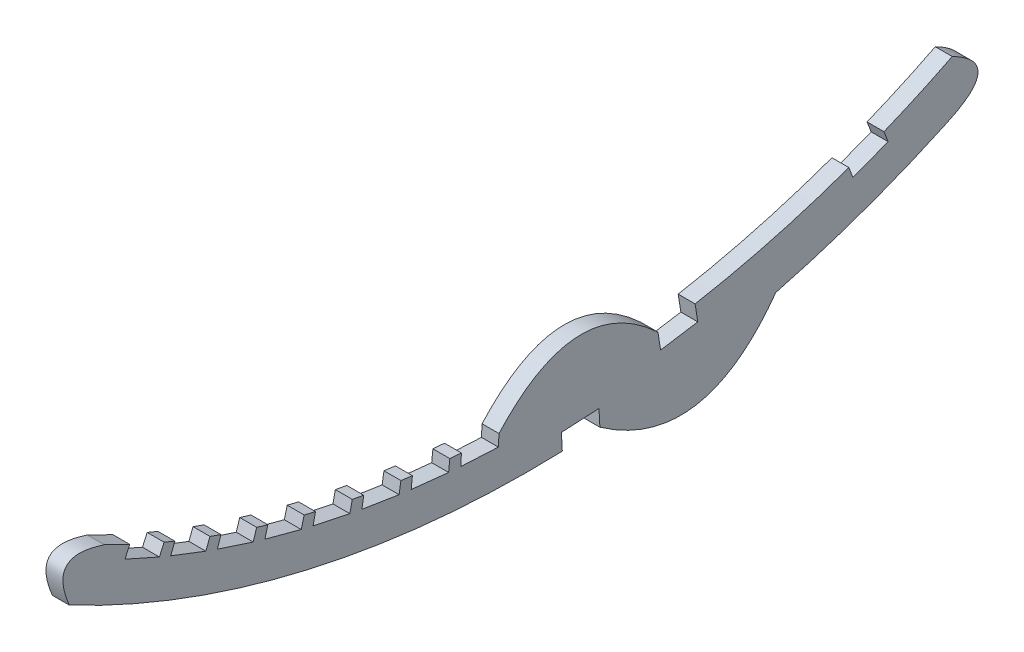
from build123d import *

# Parameters (mm, degrees)
BOSS_EXTRUDE1_DEPTH = 18


with BuildPart() as part:
    # Sketch1 → Boss-Extrude1 (new body)
    with BuildSketch(Plane(origin=(0, 0, 0), x_dir=(0, 0, -1), z_dir=(1, 0, 0))):
        with BuildLine():
            Line((139.496518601, -1008.595420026), (159.250285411, -1005.466730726))
            Line((159.250285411, -1005.466730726), (179.004052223, -1002.338041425))
            Line((179.004052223, -1002.338041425), (178.065445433, -996.411911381))
            Line((178.065445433, -996.411911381), (176.15694183, -984.362093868))
            ThreePointArc((176.15694183, -984.362093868), (258.819045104, -965.925826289), (339.624660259, -940.561050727))
            Line((339.624660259, -940.561050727), (343.996756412, -951.950750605))
            Line((343.996756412, -951.950750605), (362.66836494, -944.783391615))
            Line((362.66836494, -944.783391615), (381.33997347, -937.616032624))
            Line((381.33997347, -937.616032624), (376.967877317, -926.226332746))
            ThreePointArc((376.967877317, -926.226332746), (413.561748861, -910.476073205), (449.499222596, -893.28072233))
            add(Edge.make_bspline(
                [(440.353085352, -953.199433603), (508.567576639, -923.50836104), (449.499222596, -893.28072233)],
                knots=[0, 0, 0, 1, 1, 1], degree=2))
            ThreePointArc((440.353085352, -953.199433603), (352.562945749, -989.039619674), (261.897418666, -1016.813523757))
            add(Edge.make_bspline(
                [(74.915375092, -1047.324059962), (184.668223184, -1124.14994039), (261.897418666, -1016.813523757)],
                knots=[0, 0, 0, 1, 1, 1], degree=2))
            Line((74.915375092, -1047.324059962), (73.983297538, -1029.538960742))
            Line((73.983297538, -1029.538960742), (54.010706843, -1030.585679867))
            Line((54.010706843, -1030.585679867), (34.03811615, -1031.632398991))
            Line((34.03811615, -1031.632398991), (34.970193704, -1049.417498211))
            ThreePointArc((34.970193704, -1049.417498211), (-234.905822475, -1023.386170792), (-489.119171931, -929.119171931))
            add(Edge.make_bspline(
                [(-489.119171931, -929.119171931), (-513.223066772, -871.781237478), (-452.011904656, -892.011904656)],
                knots=[0, 0, 0, 1, 1, 1], degree=2))
            ThreePointArc((-452.011904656, -892.011904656), (-438.518841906, -898.721995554), (-424.926196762, -905.227997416))
            Line((-424.926196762, -905.227997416), (-429.888391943, -916.373270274))
            Line((-429.888391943, -916.373270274), (-411.617482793, -924.508003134))
            Line((-411.617482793, -924.508003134), (-393.34657364, -932.642735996))
            Line((-393.34657364, -932.642735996), (-388.384378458, -921.497463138))
            ThreePointArc((-388.384378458, -921.497463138), (-382.683432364, -923.879532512), (-376.967877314, -926.226332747))
            Line((-376.967877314, -926.226332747), (-381.339973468, -937.616032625))
            Line((-381.339973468, -937.616032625), (-362.66836494, -944.783391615))
            Line((-362.66836494, -944.783391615), (-343.99675641, -951.950750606))
            Line((-343.99675641, -951.950750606), (-339.624660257, -940.561050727))
            ThreePointArc((-339.624660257, -940.561050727), (-333.806859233, -942.641491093), (-327.976315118, -944.68594608))
            Line((-327.976315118, -944.68594608), (-331.746328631, -956.288854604))
            Line((-331.746328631, -956.288854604), (-312.725198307, -962.469194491))
            Line((-312.725198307, -962.469194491), (-293.704067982, -968.649534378))
            Line((-293.704067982, -968.649534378), (-289.934054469, -957.046625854))
            ThreePointArc((-289.934054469, -957.046625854), (-284.015344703, -958.819734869), (-278.08579264, -960.5562409))
            Line((-278.08579264, -960.5562409), (-281.243390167, -972.340555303))
            Line((-281.243390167, -972.340555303), (-261.924873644, -977.516936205))
            Line((-261.924873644, -977.516936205), (-242.606357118, -982.693317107))
            Line((-242.606357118, -982.693317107), (-239.44875959, -970.909002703))
            ThreePointArc((-239.44875959, -970.909002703), (-233.445363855, -972.369920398), (-227.433056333, -973.793717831))
            Line((-227.433056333, -973.793717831), (-229.96958312, -985.727138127))
            Line((-229.96958312, -985.727138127), (-210.406631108, -989.885371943))
            Line((-210.406631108, -989.885371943), (-190.843679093, -994.043605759))
            Line((-190.843679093, -994.043605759), (-188.307152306, -982.110185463))
            ThreePointArc((-188.307152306, -982.110185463), (-182.235525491, -983.254907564), (-176.156941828, -984.362093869))
            Line((-176.156941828, -984.362093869), (-178.06544543, -996.411911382))
            Line((-178.06544543, -996.411911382), (-158.311678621, -999.540600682))
            Line((-158.311678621, -999.540600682), (-138.557911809, -1002.669289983))
            Line((-138.557911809, -1002.669289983), (-136.649408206, -990.61947247))
            ThreePointArc((-136.649408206, -990.61947247), (-130.526192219, -991.444861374), (-124.397993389, -992.23240183))
            Line((-124.397993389, -992.23240183), (-125.673242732, -1004.365588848))
            Line((-125.673242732, -1004.365588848), (-105.782804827, -1006.456158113))
            Line((-105.782804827, -1006.456158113), (-85.89236692, -1008.546727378))
            Line((-85.89236692, -1008.546727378), (-84.617117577, -996.41354036))
            ThreePointArc((-84.617117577, -996.41354036), (-78.459095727, -996.917333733), (-72.298078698, -997.383069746))
            Line((-72.298078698, -997.383069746), (-72.936578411, -1009.566370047))
            Line((-72.936578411, -1009.566370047), (-52.963987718, -1010.613089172))
            Line((-52.963987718, -1010.613089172), (-32.991397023, -1011.659808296))
            Line((-32.991397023, -1011.659808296), (-32.35289731, -999.476507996))
            add(Edge.make_bspline(
                [(136.649408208, -990.61947247), (49.335159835, -909.067419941), (-32.35289731, -999.476507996)],
                knots=[0, 0, 0, 1, 1, 1], degree=2))
            Line((136.649408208, -990.61947247), (138.557911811, -1002.669289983))
            Line((138.557911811, -1002.669289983), (139.496518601, -1008.595420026))
        make_face()
    extrude(amount=BOSS_EXTRUDE1_DEPTH)


solid = part.part
